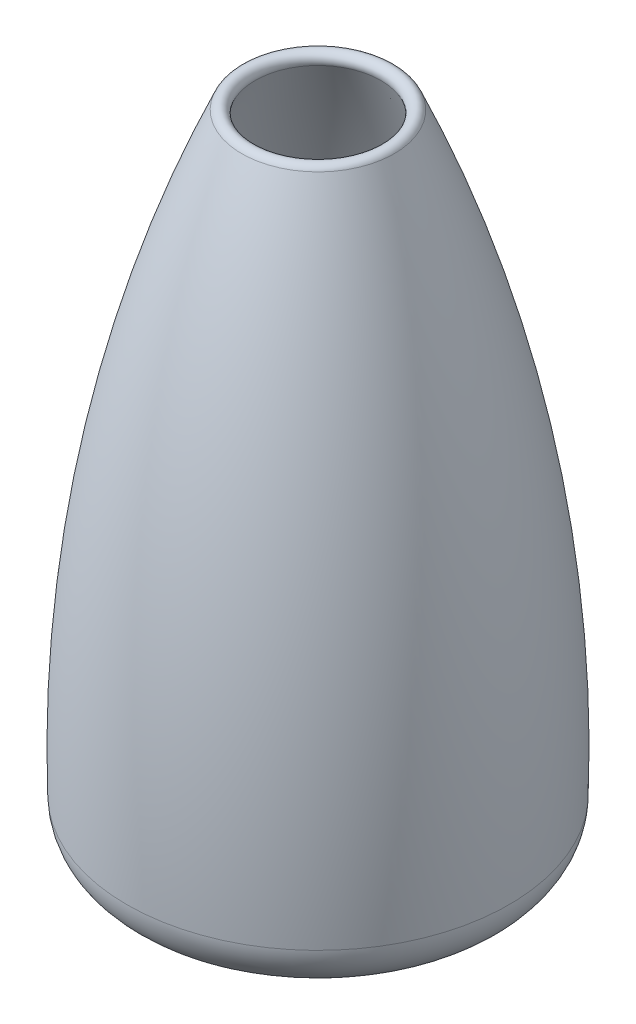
from build123d import *


with BuildPart() as part:
    # Sketch1 → Revolve1 (revolve)
    with BuildSketch(Plane.XY, mode=Mode.PRIVATE) as revolve1_sk:
        with BuildLine():
            Line((0, 0), (28.980809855, 0))
            ThreePointArc((28.980809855, 0), (35.949460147, 2.827977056), (38.976673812, 9.712417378))
            ThreePointArc((38.976673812, 9.712417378), (33.945686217, 71.472564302), (15.552992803, 130.644647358))
            ThreePointArc((15.552992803, 130.644647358), (13.551029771, 131.407732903), (12.827412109, 129.391168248))
            ThreePointArc((12.827412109, 129.391168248), (28.172051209, 83.461027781), (31.36113978, 35.140582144))
            ThreePointArc((31.36113978, 35.140582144), (25.094400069, 21.810823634), (11.400014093, 16.38696142))
            Line((11.400014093, 16.38696142), (0, 16.38696142))
            Line((0, 16.38696142), (0, 0))
        make_face()
    revolve(revolve1_sk.sketch.rotate(Axis((0, 0, 0), (0, 1, 0)), 90), axis=Axis((0, 0, 0), (0, 1, 0)))


solid = part.part
